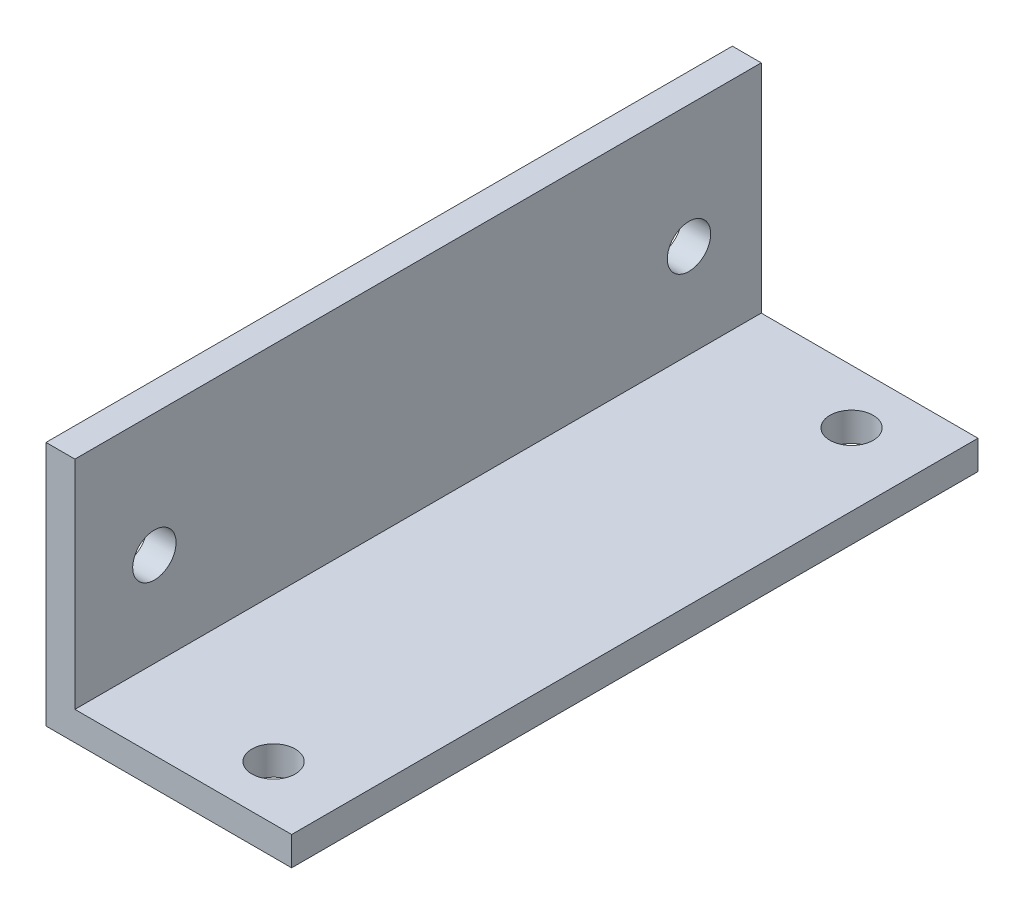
ISO-10303-21;
HEADER;
FILE_DESCRIPTION(('STEP AP214'),'2;1');
FILE_NAME('part.step','',(''),(''),'','','');
FILE_SCHEMA(('AUTOMOTIVE_DESIGN { 1 0 10303 214 1 1 1 1 }'));
ENDSEC;
DATA;
#1=APPLICATION_CONTEXT('core data for automotive mechanical design processes');
#2=APPLICATION_PROTOCOL_DEFINITION('international standard','automotive_design',2000,#1);
#3=PRODUCT_CONTEXT('',#1,'mechanical');
#4=PRODUCT('Part','Part','',(#3));
#5=PRODUCT_RELATED_PRODUCT_CATEGORY('part','',(#4));
#6=PRODUCT_DEFINITION_FORMATION('','',#4);
#7=PRODUCT_DEFINITION_CONTEXT('part definition',#1,'design');
#8=PRODUCT_DEFINITION('design','',#6,#7);
#9=PRODUCT_DEFINITION_SHAPE('','',#8);
#10=(LENGTH_UNIT() NAMED_UNIT(*) SI_UNIT(.MILLI.,.METRE.));
#11=(NAMED_UNIT(*) PLANE_ANGLE_UNIT() SI_UNIT($,.RADIAN.));
#12=(NAMED_UNIT(*) SI_UNIT($,.STERADIAN.) SOLID_ANGLE_UNIT());
#13=UNCERTAINTY_MEASURE_WITH_UNIT(LENGTH_MEASURE(1.E-05),#10,'distance_accuracy_value','');
#14=(GEOMETRIC_REPRESENTATION_CONTEXT(3) GLOBAL_UNCERTAINTY_ASSIGNED_CONTEXT((#13)) GLOBAL_UNIT_ASSIGNED_CONTEXT((#10,
#11,#12)) REPRESENTATION_CONTEXT('',''));
#15=CARTESIAN_POINT('',(0.,0.,0.));
#16=DIRECTION('',(0.,0.,1.));
#17=DIRECTION('',(1.,0.,0.));
#18=AXIS2_PLACEMENT_3D('',#15,#16,#17);
#19=CARTESIAN_POINT('',(2.,17.,125.));
#20=DIRECTION('',(0.,-1.,0.));
#21=DIRECTION('',(0.,0.,-1.));
#22=AXIS2_PLACEMENT_3D('',#19,#20,#21);
#23=PLANE('',#22);
#24=DIRECTION('',(0.,0.,-1.));
#25=VECTOR('',#24,1.);
#26=CARTESIAN_POINT('',(0.,17.,125.));
#27=LINE('',#26,#25);
#28=CARTESIAN_POINT('',(0.,17.,47.5));
#29=VERTEX_POINT('',#28);
#30=CARTESIAN_POINT('',(0.,17.,0.));
#31=VERTEX_POINT('',#30);
#32=EDGE_CURVE('E42',#29,#31,#27,.T.);
#33=ORIENTED_EDGE('',*,*,#32,.F.);
#34=DIRECTION('',(-1.,0.,0.));
#35=VECTOR('',#34,1.);
#36=CARTESIAN_POINT('',(74.,17.,47.5));
#37=LINE('',#36,#35);
#38=CARTESIAN_POINT('',(2.,17.,47.5));
#39=VERTEX_POINT('',#38);
#40=EDGE_CURVE('E85',#39,#29,#37,.T.);
#41=ORIENTED_EDGE('',*,*,#40,.F.);
#42=DIRECTION('',(0.,0.,-1.));
#43=VECTOR('',#42,1.);
#44=CARTESIAN_POINT('',(2.,17.,125.));
#45=LINE('',#44,#43);
#46=CARTESIAN_POINT('',(2.,17.,0.));
#47=VERTEX_POINT('',#46);
#48=EDGE_CURVE('E56',#39,#47,#45,.T.);
#49=ORIENTED_EDGE('',*,*,#48,.T.);
#50=DIRECTION('',(-1.,0.,0.));
#51=VECTOR('',#50,1.);
#52=CARTESIAN_POINT('',(2.,17.,0.));
#53=LINE('',#52,#51);
#54=EDGE_CURVE('E102',#47,#31,#53,.T.);
#55=ORIENTED_EDGE('',*,*,#54,.T.);
#56=EDGE_LOOP('',(#33,#41,#49,#55));
#57=FACE_BOUND('',#56,.T.);
#58=ADVANCED_FACE('F35',(#57),#23,.F.);
#59=CARTESIAN_POINT('',(0.,17.,125.));
#60=DIRECTION('',(1.,0.,0.));
#61=DIRECTION('',(0.,1.,0.));
#62=AXIS2_PLACEMENT_3D('',#59,#60,#61);
#63=PLANE('',#62);
#64=CARTESIAN_POINT('',(0.,8.5,42.));
#65=DIRECTION('',(-1.,0.,0.));
#66=DIRECTION('',(0.,-1.,0.));
#67=AXIS2_PLACEMENT_3D('',#64,#65,#66);
#68=CIRCLE('',#67,1.5);
#69=CARTESIAN_POINT('',(0.,6.99999999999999,42.));
#70=VERTEX_POINT('',#69);
#71=EDGE_CURVE('E113',#70,#70,#68,.T.);
#72=ORIENTED_EDGE('',*,*,#71,.F.);
#73=EDGE_LOOP('',(#72));
#74=FACE_BOUND('',#73,.T.);
#75=CARTESIAN_POINT('',(0.,8.5,5.));
#76=DIRECTION('',(-1.,0.,0.));
#77=DIRECTION('',(0.,-1.,0.));
#78=AXIS2_PLACEMENT_3D('',#75,#76,#77);
#79=CIRCLE('',#78,1.5);
#80=CARTESIAN_POINT('',(0.,7.,5.));
#81=VERTEX_POINT('',#80);
#82=EDGE_CURVE('E110',#81,#81,#79,.T.);
#83=ORIENTED_EDGE('',*,*,#82,.F.);
#84=EDGE_LOOP('',(#83));
#85=FACE_BOUND('',#84,.T.);
#86=DIRECTION('',(0.,0.,-1.));
#87=VECTOR('',#86,1.);
#88=CARTESIAN_POINT('',(0.,0.,125.));
#89=LINE('',#88,#87);
#90=CARTESIAN_POINT('',(0.,0.,47.5));
#91=VERTEX_POINT('',#90);
#92=CARTESIAN_POINT('',(0.,0.,0.));
#93=VERTEX_POINT('',#92);
#94=EDGE_CURVE('E98',#91,#93,#89,.T.);
#95=ORIENTED_EDGE('',*,*,#94,.F.);
#96=DIRECTION('',(0.,-1.,0.));
#97=VECTOR('',#96,1.);
#98=CARTESIAN_POINT('',(0.,17.,47.5));
#99=LINE('',#98,#97);
#100=EDGE_CURVE('E88',#29,#91,#99,.T.);
#101=ORIENTED_EDGE('',*,*,#100,.F.);
#102=ORIENTED_EDGE('',*,*,#32,.T.);
#103=DIRECTION('',(0.,-1.,0.));
#104=VECTOR('',#103,1.);
#105=CARTESIAN_POINT('',(0.,17.,0.));
#106=LINE('',#105,#104);
#107=EDGE_CURVE('E128',#31,#93,#106,.T.);
#108=ORIENTED_EDGE('',*,*,#107,.T.);
#109=EDGE_LOOP('',(#95,#101,#102,#108));
#110=FACE_BOUND('',#109,.T.);
#111=ADVANCED_FACE('F95',(#74,#85,#110),#63,.F.);
#112=CARTESIAN_POINT('',(0.,0.,125.));
#113=DIRECTION('',(0.,1.,0.));
#114=DIRECTION('',(0.,0.,1.));
#115=AXIS2_PLACEMENT_3D('',#112,#113,#114);
#116=PLANE('',#115);
#117=CARTESIAN_POINT('',(12.,0.,43.75));
#118=DIRECTION('',(0.,1.,0.));
#119=DIRECTION('',(0.,0.,1.));
#120=AXIS2_PLACEMENT_3D('',#117,#118,#119);
#121=CIRCLE('',#120,1.5);
#122=CARTESIAN_POINT('',(12.,0.,45.25));
#123=VERTEX_POINT('',#122);
#124=EDGE_CURVE('E167',#123,#123,#121,.T.);
#125=ORIENTED_EDGE('',*,*,#124,.T.);
#126=EDGE_LOOP('',(#125));
#127=FACE_BOUND('',#126,.T.);
#128=CARTESIAN_POINT('',(12.,0.,3.75));
#129=DIRECTION('',(0.,1.,0.));
#130=DIRECTION('',(0.,0.,1.));
#131=AXIS2_PLACEMENT_3D('',#128,#129,#130);
#132=CIRCLE('',#131,1.5);
#133=CARTESIAN_POINT('',(12.,0.,5.25));
#134=VERTEX_POINT('',#133);
#135=EDGE_CURVE('E99',#134,#134,#132,.T.);
#136=ORIENTED_EDGE('',*,*,#135,.T.);
#137=EDGE_LOOP('',(#136));
#138=FACE_BOUND('',#137,.T.);
#139=DIRECTION('',(0.,0.,-1.));
#140=VECTOR('',#139,1.);
#141=CARTESIAN_POINT('',(17.,0.,125.));
#142=LINE('',#141,#140);
#143=CARTESIAN_POINT('',(17.,0.,47.5));
#144=VERTEX_POINT('',#143);
#145=CARTESIAN_POINT('',(17.,0.,0.));
#146=VERTEX_POINT('',#145);
#147=EDGE_CURVE('E104',#144,#146,#142,.T.);
#148=ORIENTED_EDGE('',*,*,#147,.F.);
#149=DIRECTION('',(-1.,0.,0.));
#150=VECTOR('',#149,1.);
#151=CARTESIAN_POINT('',(74.,0.,47.5));
#152=LINE('',#151,#150);
#153=EDGE_CURVE('E91',#144,#91,#152,.T.);
#154=ORIENTED_EDGE('',*,*,#153,.T.);
#155=ORIENTED_EDGE('',*,*,#94,.T.);
#156=DIRECTION('',(1.,0.,0.));
#157=VECTOR('',#156,1.);
#158=CARTESIAN_POINT('',(0.,0.,0.));
#159=LINE('',#158,#157);
#160=EDGE_CURVE('E130',#93,#146,#159,.T.);
#161=ORIENTED_EDGE('',*,*,#160,.T.);
#162=EDGE_LOOP('',(#148,#154,#155,#161));
#163=FACE_BOUND('',#162,.T.);
#164=ADVANCED_FACE('F153',(#127,#138,#163),#116,.F.);
#165=CARTESIAN_POINT('',(17.,0.,125.));
#166=DIRECTION('',(-1.,0.,0.));
#167=DIRECTION('',(0.,0.,1.));
#168=AXIS2_PLACEMENT_3D('',#165,#166,#167);
#169=PLANE('',#168);
#170=DIRECTION('',(0.,0.,-1.));
#171=VECTOR('',#170,1.);
#172=CARTESIAN_POINT('',(17.,2.,125.));
#173=LINE('',#172,#171);
#174=CARTESIAN_POINT('',(17.,2.,47.5));
#175=VERTEX_POINT('',#174);
#176=CARTESIAN_POINT('',(17.,2.,0.));
#177=VERTEX_POINT('',#176);
#178=EDGE_CURVE('E144',#175,#177,#173,.T.);
#179=ORIENTED_EDGE('',*,*,#178,.F.);
#180=DIRECTION('',(0.,-1.,0.));
#181=VECTOR('',#180,1.);
#182=CARTESIAN_POINT('',(17.,0.,47.5));
#183=LINE('',#182,#181);
#184=EDGE_CURVE('E119',#175,#144,#183,.T.);
#185=ORIENTED_EDGE('',*,*,#184,.T.);
#186=ORIENTED_EDGE('',*,*,#147,.T.);
#187=DIRECTION('',(0.,1.,0.));
#188=VECTOR('',#187,1.);
#189=CARTESIAN_POINT('',(17.,0.,0.));
#190=LINE('',#189,#188);
#191=EDGE_CURVE('E133',#146,#177,#190,.T.);
#192=ORIENTED_EDGE('',*,*,#191,.T.);
#193=EDGE_LOOP('',(#179,#185,#186,#192));
#194=FACE_BOUND('',#193,.T.);
#195=ADVANCED_FACE('F148',(#194),#169,.F.);
#196=CARTESIAN_POINT('',(17.,2.,125.));
#197=DIRECTION('',(0.,-1.,0.));
#198=DIRECTION('',(1.,0.,0.));
#199=AXIS2_PLACEMENT_3D('',#196,#197,#198);
#200=PLANE('',#199);
#201=CARTESIAN_POINT('',(12.,2.,43.75));
#202=DIRECTION('',(0.,1.,0.));
#203=DIRECTION('',(1.,0.,0.));
#204=AXIS2_PLACEMENT_3D('',#201,#202,#203);
#205=CIRCLE('',#204,1.5);
#206=CARTESIAN_POINT('',(13.5,2.,43.75));
#207=VERTEX_POINT('',#206);
#208=EDGE_CURVE('E170',#207,#207,#205,.T.);
#209=ORIENTED_EDGE('',*,*,#208,.F.);
#210=EDGE_LOOP('',(#209));
#211=FACE_BOUND('',#210,.T.);
#212=CARTESIAN_POINT('',(12.,2.,3.75));
#213=DIRECTION('',(0.,1.,0.));
#214=DIRECTION('',(-1.,0.,0.));
#215=AXIS2_PLACEMENT_3D('',#212,#213,#214);
#216=CIRCLE('',#215,1.5);
#217=CARTESIAN_POINT('',(10.5,2.,3.75));
#218=VERTEX_POINT('',#217);
#219=EDGE_CURVE('E164',#218,#218,#216,.T.);
#220=ORIENTED_EDGE('',*,*,#219,.F.);
#221=EDGE_LOOP('',(#220));
#222=FACE_BOUND('',#221,.T.);
#223=DIRECTION('',(0.,0.,-1.));
#224=VECTOR('',#223,1.);
#225=CARTESIAN_POINT('',(2.,1.99999999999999,125.));
#226=LINE('',#225,#224);
#227=CARTESIAN_POINT('',(2.,1.99999999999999,47.5));
#228=VERTEX_POINT('',#227);
#229=CARTESIAN_POINT('',(2.,1.99999999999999,0.));
#230=VERTEX_POINT('',#229);
#231=EDGE_CURVE('E142',#228,#230,#226,.T.);
#232=ORIENTED_EDGE('',*,*,#231,.F.);
#233=DIRECTION('',(1.,0.,0.));
#234=VECTOR('',#233,1.);
#235=CARTESIAN_POINT('',(17.,2.,47.5));
#236=LINE('',#235,#234);
#237=EDGE_CURVE('E49',#228,#175,#236,.T.);
#238=ORIENTED_EDGE('',*,*,#237,.T.);
#239=ORIENTED_EDGE('',*,*,#178,.T.);
#240=DIRECTION('',(-1.,0.,0.));
#241=VECTOR('',#240,1.);
#242=CARTESIAN_POINT('',(17.,2.,0.));
#243=LINE('',#242,#241);
#244=EDGE_CURVE('E136',#177,#230,#243,.T.);
#245=ORIENTED_EDGE('',*,*,#244,.T.);
#246=EDGE_LOOP('',(#232,#238,#239,#245));
#247=FACE_BOUND('',#246,.T.);
#248=ADVANCED_FACE('F159',(#211,#222,#247),#200,.F.);
#249=CARTESIAN_POINT('',(2.,1.99999999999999,125.));
#250=DIRECTION('',(-1.,0.,0.));
#251=DIRECTION('',(0.,-1.,0.));
#252=AXIS2_PLACEMENT_3D('',#249,#250,#251);
#253=PLANE('',#252);
#254=CARTESIAN_POINT('',(2.,8.5,42.));
#255=DIRECTION('',(-1.,0.,0.));
#256=DIRECTION('',(0.,-1.,0.));
#257=AXIS2_PLACEMENT_3D('',#254,#255,#256);
#258=CIRCLE('',#257,1.5);
#259=CARTESIAN_POINT('',(2.,6.99999999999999,42.));
#260=VERTEX_POINT('',#259);
#261=EDGE_CURVE('E111',#260,#260,#258,.T.);
#262=ORIENTED_EDGE('',*,*,#261,.T.);
#263=EDGE_LOOP('',(#262));
#264=FACE_BOUND('',#263,.T.);
#265=CARTESIAN_POINT('',(2.,8.5,5.));
#266=DIRECTION('',(-1.,0.,0.));
#267=DIRECTION('',(0.,-1.,0.));
#268=AXIS2_PLACEMENT_3D('',#265,#266,#267);
#269=CIRCLE('',#268,1.5);
#270=CARTESIAN_POINT('',(2.,7.,5.));
#271=VERTEX_POINT('',#270);
#272=EDGE_CURVE('E108',#271,#271,#269,.T.);
#273=ORIENTED_EDGE('',*,*,#272,.T.);
#274=EDGE_LOOP('',(#273));
#275=FACE_BOUND('',#274,.T.);
#276=ORIENTED_EDGE('',*,*,#48,.F.);
#277=DIRECTION('',(0.,-1.,0.));
#278=VECTOR('',#277,1.);
#279=CARTESIAN_POINT('',(2.,1.99999999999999,47.5));
#280=LINE('',#279,#278);
#281=EDGE_CURVE('E11',#39,#228,#280,.T.);
#282=ORIENTED_EDGE('',*,*,#281,.T.);
#283=ORIENTED_EDGE('',*,*,#231,.T.);
#284=DIRECTION('',(0.,1.,0.));
#285=VECTOR('',#284,1.);
#286=CARTESIAN_POINT('',(2.,1.99999999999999,0.));
#287=LINE('',#286,#285);
#288=EDGE_CURVE('E139',#230,#47,#287,.T.);
#289=ORIENTED_EDGE('',*,*,#288,.T.);
#290=EDGE_LOOP('',(#276,#282,#283,#289));
#291=FACE_BOUND('',#290,.T.);
#292=ADVANCED_FACE('F179',(#264,#275,#291),#253,.F.);
#293=CARTESIAN_POINT('',(0.,0.,0.));
#294=DIRECTION('',(0.,0.,1.));
#295=DIRECTION('',(1.,0.,0.));
#296=AXIS2_PLACEMENT_3D('',#293,#294,#295);
#297=PLANE('',#296);
#298=ORIENTED_EDGE('',*,*,#54,.F.);
#299=ORIENTED_EDGE('',*,*,#288,.F.);
#300=ORIENTED_EDGE('',*,*,#244,.F.);
#301=ORIENTED_EDGE('',*,*,#191,.F.);
#302=ORIENTED_EDGE('',*,*,#160,.F.);
#303=ORIENTED_EDGE('',*,*,#107,.F.);
#304=EDGE_LOOP('',(#298,#299,#300,#301,#302,#303));
#305=FACE_BOUND('',#304,.T.);
#306=ADVANCED_FACE('F155',(#305),#297,.F.);
#307=CARTESIAN_POINT('',(30.,8.5,5.));
#308=DIRECTION('',(-1.,0.,0.));
#309=DIRECTION('',(0.,-1.,0.));
#310=AXIS2_PLACEMENT_3D('',#307,#308,#309);
#311=CYLINDRICAL_SURFACE('',#310,1.5);
#312=ORIENTED_EDGE('',*,*,#82,.T.);
#313=EDGE_LOOP('',(#312));
#314=FACE_BOUND('',#313,.T.);
#315=ORIENTED_EDGE('',*,*,#272,.F.);
#316=EDGE_LOOP('',(#315));
#317=FACE_BOUND('',#316,.T.);
#318=ADVANCED_FACE('F263',(#314,#317),#311,.F.);
#319=CARTESIAN_POINT('',(30.,8.5,42.));
#320=DIRECTION('',(-1.,0.,0.));
#321=DIRECTION('',(0.,-1.,0.));
#322=AXIS2_PLACEMENT_3D('',#319,#320,#321);
#323=CYLINDRICAL_SURFACE('',#322,1.5);
#324=ORIENTED_EDGE('',*,*,#71,.T.);
#325=EDGE_LOOP('',(#324));
#326=FACE_BOUND('',#325,.T.);
#327=ORIENTED_EDGE('',*,*,#261,.F.);
#328=EDGE_LOOP('',(#327));
#329=FACE_BOUND('',#328,.T.);
#330=ADVANCED_FACE('F232',(#326,#329),#323,.F.);
#331=CARTESIAN_POINT('',(74.,17.,47.5));
#332=DIRECTION('',(0.,0.,-1.));
#333=DIRECTION('',(-1.,0.,0.));
#334=AXIS2_PLACEMENT_3D('',#331,#332,#333);
#335=PLANE('',#334);
#336=ORIENTED_EDGE('',*,*,#237,.F.);
#337=ORIENTED_EDGE('',*,*,#281,.F.);
#338=ORIENTED_EDGE('',*,*,#40,.T.);
#339=ORIENTED_EDGE('',*,*,#100,.T.);
#340=ORIENTED_EDGE('',*,*,#153,.F.);
#341=ORIENTED_EDGE('',*,*,#184,.F.);
#342=EDGE_LOOP('',(#336,#337,#338,#339,#340,#341));
#343=FACE_BOUND('',#342,.T.);
#344=ADVANCED_FACE('F87',(#343),#335,.F.);
#345=CARTESIAN_POINT('',(12.,-8.00000000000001,3.75));
#346=DIRECTION('',(0.,1.,0.));
#347=DIRECTION('',(-1.,0.,0.));
#348=AXIS2_PLACEMENT_3D('',#345,#346,#347);
#349=CYLINDRICAL_SURFACE('',#348,1.5);
#350=ORIENTED_EDGE('',*,*,#219,.T.);
#351=EDGE_LOOP('',(#350));
#352=FACE_BOUND('',#351,.T.);
#353=ORIENTED_EDGE('',*,*,#135,.F.);
#354=EDGE_LOOP('',(#353));
#355=FACE_BOUND('',#354,.T.);
#356=ADVANCED_FACE('F183',(#352,#355),#349,.F.);
#357=CARTESIAN_POINT('',(12.,-8.00000000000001,43.75));
#358=DIRECTION('',(0.,1.,0.));
#359=DIRECTION('',(-1.,0.,0.));
#360=AXIS2_PLACEMENT_3D('',#357,#358,#359);
#361=CYLINDRICAL_SURFACE('',#360,1.5);
#362=ORIENTED_EDGE('',*,*,#208,.T.);
#363=EDGE_LOOP('',(#362));
#364=FACE_BOUND('',#363,.T.);
#365=ORIENTED_EDGE('',*,*,#124,.F.);
#366=EDGE_LOOP('',(#365));
#367=FACE_BOUND('',#366,.T.);
#368=ADVANCED_FACE('F174',(#364,#367),#361,.F.);
#369=CLOSED_SHELL('',(#58,#111,#164,#195,#248,#292,#306,#318,#330,#344,#356,#368));
#370=MANIFOLD_SOLID_BREP('B2',#369);
#371=ADVANCED_BREP_SHAPE_REPRESENTATION('',(#18,#370),#14);
#372=SHAPE_DEFINITION_REPRESENTATION(#9,#371);
ENDSEC;
END-ISO-10303-21;
